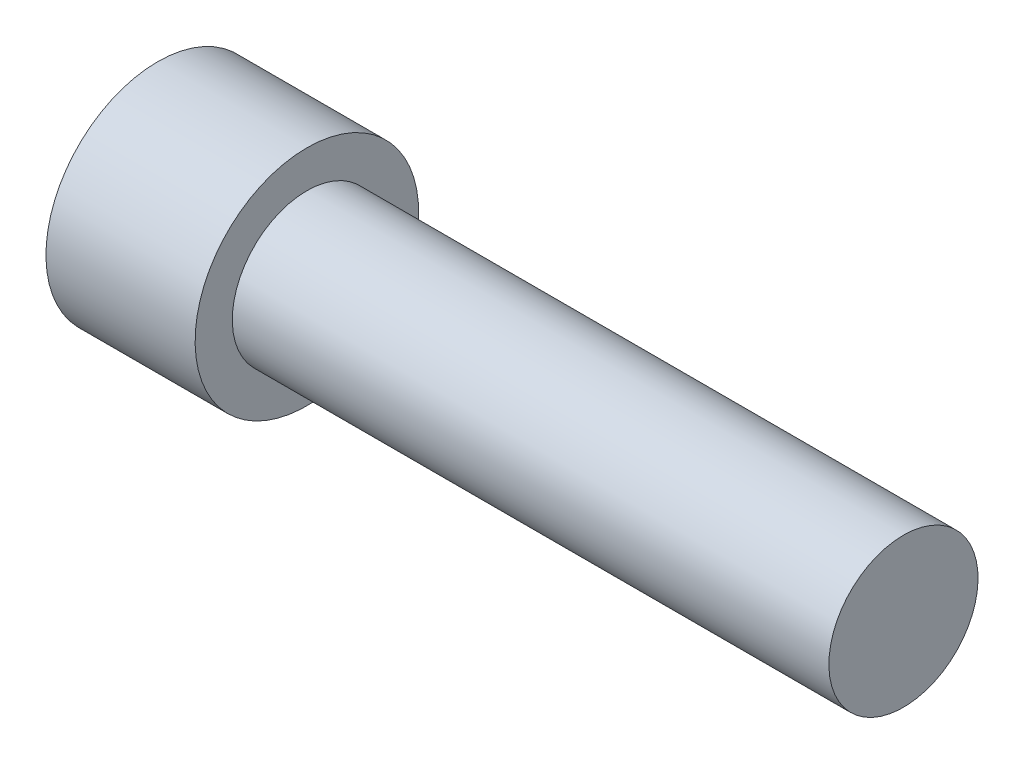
from build123d import *

# Parameters (mm, degrees)
CUT_EXTRUDE1_DEPTH = 4.826


with BuildPart() as part:
    # Sketch1 → Revolve1 (revolve)
    with BuildSketch(Plane.XY):
        Polygon((47.625, 0), (0, 0), (0, 7.1374), (9.525, 7.1374), (9.525, 4.7625), (47.625, 4.7625), align=None)
    revolve(axis=Axis((47.625, 0, 0), (-1, 0, 0)))

    # Sketch2 → Cut-Extrude1 (cut)
    with BuildSketch(Plane.ZY):
        Polygon((4.582717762, 0), (2.291358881, 3.96875), (-2.291358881, 3.96875), (-4.582717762, 0), (-2.291358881, -3.96875), (2.291358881, -3.96875), align=None)
    extrude(amount=-CUT_EXTRUDE1_DEPTH, mode=Mode.SUBTRACT)


solid = part.part
